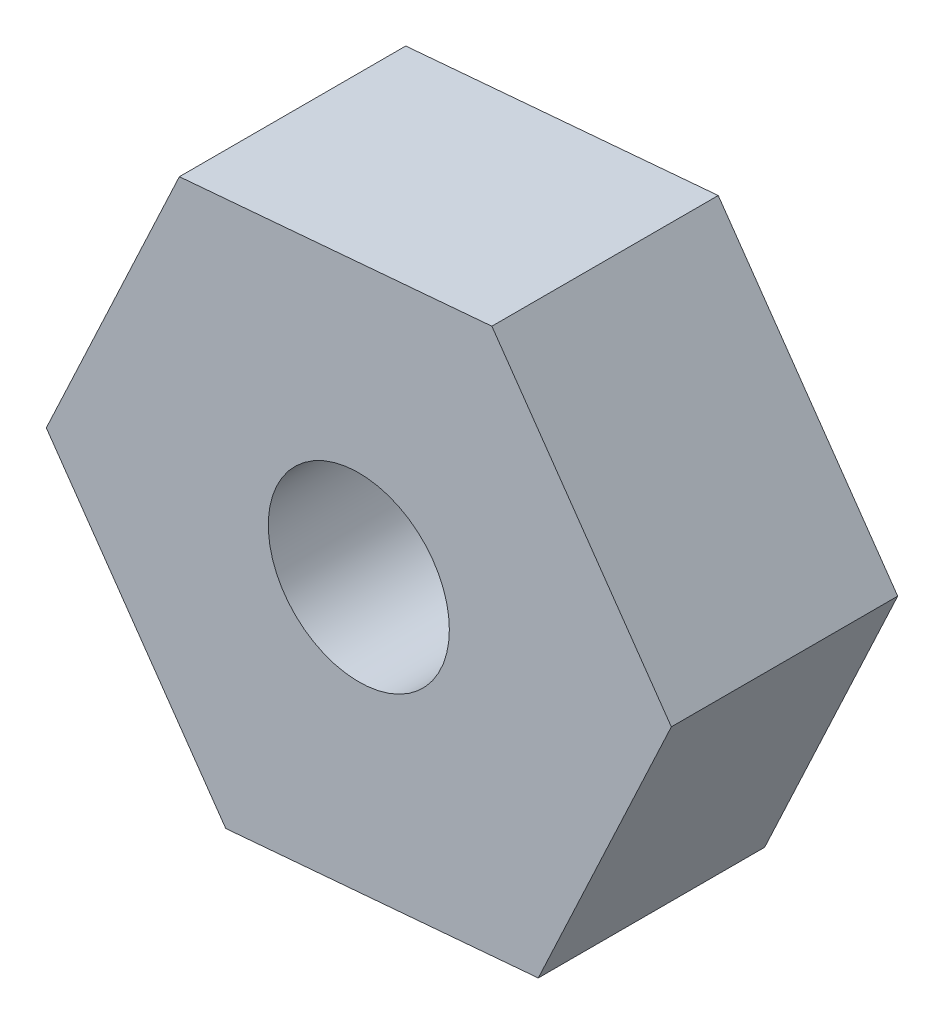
from build123d import *

# Parameters (mm, degrees)
SKETCH1_R           = 2.54
BOSS_EXTRUDE1_DEPTH = 6.35


with BuildPart() as part:
    # Sketch1 → Boss-Extrude1 (new body)
    with BuildSketch(Plane.XY):
        Polygon((5.034085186, -7.216452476), (8.766673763, 0.751419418), (3.732588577, 7.967871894), (-5.034085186, 7.216452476), (-8.766673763, -0.751419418), (-3.732588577, -7.967871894), align=None)
        Circle(SKETCH1_R, mode=Mode.SUBTRACT)
    extrude(amount=BOSS_EXTRUDE1_DEPTH)


solid = part.part
